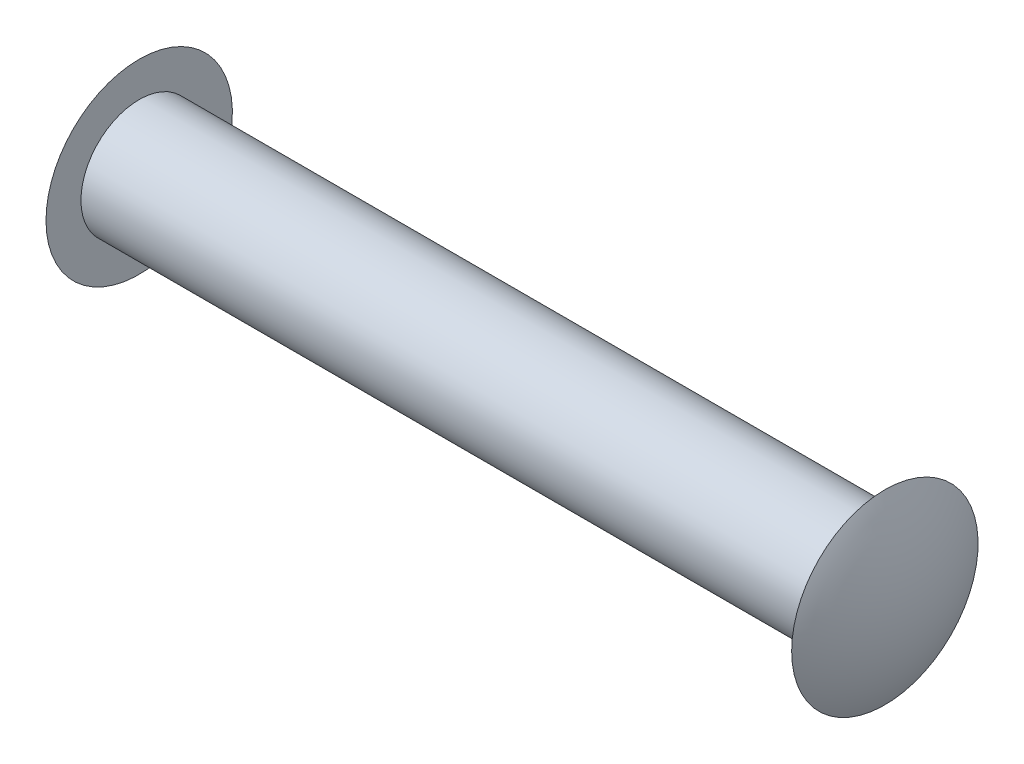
from build123d import *


with BuildPart() as part:
    # Sketch1 → Latch Pin- Revolve1 (revolve)
    with BuildSketch(Plane.XY, mode=Mode.PRIVATE) as latch_pin_revolve1_sk:
        with BuildLine():
            Line((0, 2.5), (16, 2.5))
            Line((16, 2.5), (16, 4))
            ThreePointArc((16, 4), (16.746211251, 2.061552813), (17, 0))
            Line((17, 0), (0, 0))
            Line((0, 0), (0, 2.5))
        make_face()
    revolve(latch_pin_revolve1_sk.sketch.rotate(Axis((0, 0, 0), (1, 0, 0)), 90), axis=Axis((0, 0, 0), (1, 0, 0)))

    # Mirror1: part across plane


with BuildPart() as part_1:
    add(part.part)
    add(part.part.mirror(Plane(origin=(0, 2.5, 0), x_dir=(0, 0, 1), z_dir=(1, 0, 0))))


solid = part_1.part
